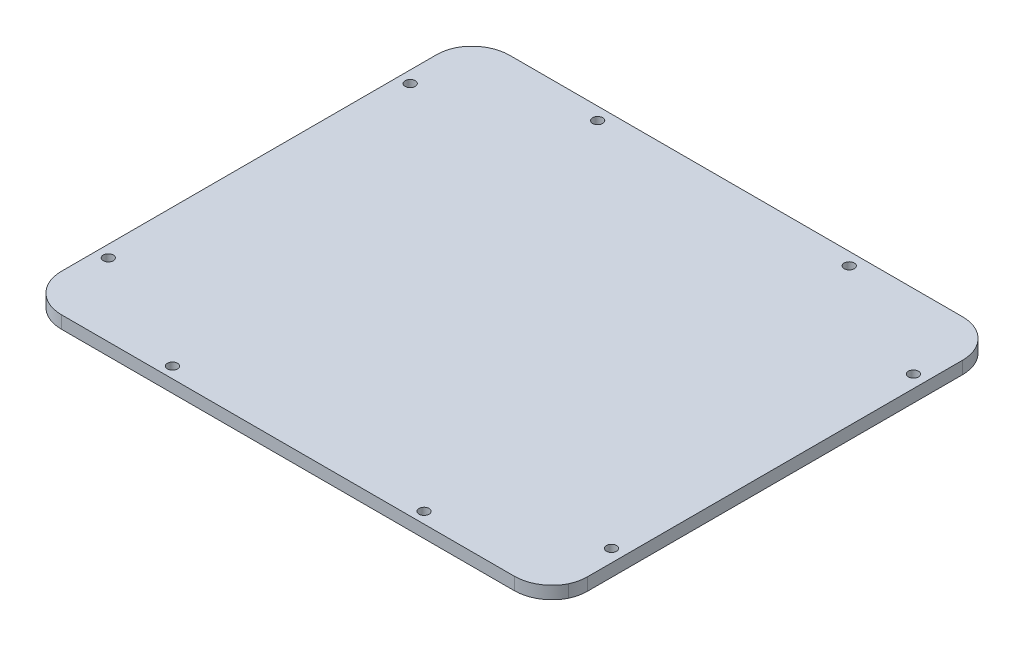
from build123d import *

# Parameters (mm, degrees)
SKETCH1_R           = 2
BOSS_EXTRUDE1_DEPTH = 5


with BuildPart() as part:
    # Sketch1 → Boss-Extrude1 (new body)
    with BuildSketch(Plane(origin=(0, 0, 0), x_dir=(1, 0, 0), z_dir=(0, 1, 0))):
        with BuildLine():
            ThreePointArc((-105, -74.5), (-100.606601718, -85.106601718), (-90, -89.5))
            Line((-90, -89.5), (90, -89.5))
            ThreePointArc((90, -89.5), (97.795876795, -87.315003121), (103.320558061, -81.396574))
            ThreePointArc((103.320558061, -81.396574), (104.352567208, -78.3277224), (104.701996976, -75.108904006))
            Line((104.701996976, -75.108904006), (104.701996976, 73.891095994))
            ThreePointArc((104.701996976, 73.891095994), (100.308598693, 84.497697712), (89.701996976, 88.891095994))
            Line((89.701996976, 88.891095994), (-90.298003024, 88.891095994))
            ThreePointArc((-90.298003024, 88.891095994), (-98.093879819, 86.706099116), (-103.618561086, 80.787669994))
            ThreePointArc((-103.618561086, 80.787669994), (-104.650570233, 77.718818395), (-105, 74.5))
            Line((-105, 74.5), (-105, -74.5))
        make_face()
        with Locations(Location((-100.298003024, -60.608904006, 0), (0, 0, 270))):
            Circle(SKETCH1_R, mode=Mode.SUBTRACT)
        with Locations(Location((-50.298003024, -85.108904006, 0), (0, 0, 270))):
            Circle(SKETCH1_R, mode=Mode.SUBTRACT)
        with Locations(Location((49.701996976, -85.108904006, 0), (0, 0, 270))):
            Circle(SKETCH1_R, mode=Mode.SUBTRACT)
        with Locations(Location((99.701996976, -60.608904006, 0), (0, 0, 270))):
            Circle(SKETCH1_R, mode=Mode.SUBTRACT)
        with Locations(Location((-100.298003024, 59.391095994, 0), (0, 0, 270))):
            Circle(SKETCH1_R, mode=Mode.SUBTRACT)
        with Locations(Location((-50.298003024, 83.891095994, 0), (0, 0, 270))):
            Circle(SKETCH1_R, mode=Mode.SUBTRACT)
        with Locations(Location((49.701996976, 83.891095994, 0), (0, 0, 270))):
            Circle(SKETCH1_R, mode=Mode.SUBTRACT)
        with Locations(Location((99.701996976, 59.391095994, 0), (0, 0, 270))):
            Circle(SKETCH1_R, mode=Mode.SUBTRACT)
    extrude(amount=BOSS_EXTRUDE1_DEPTH)


solid = part.part
